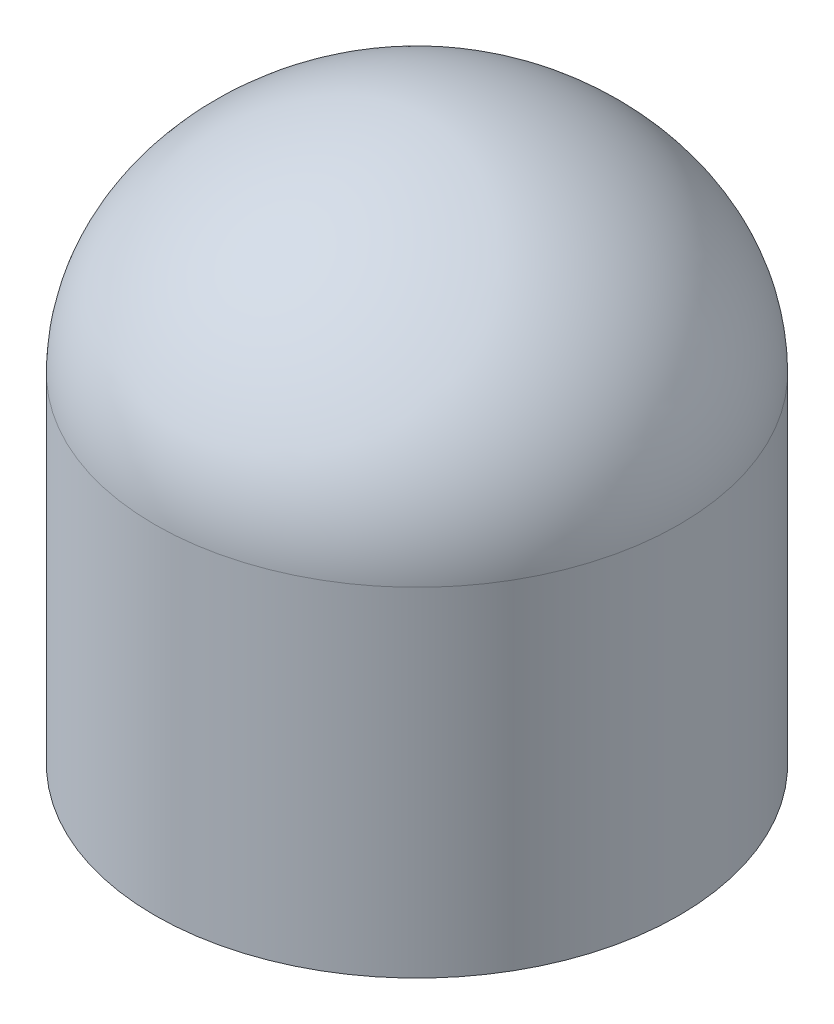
ISO-10303-21;
HEADER;
FILE_DESCRIPTION(('STEP AP214'),'2;1');
FILE_NAME('part.step','',(''),(''),'','','');
FILE_SCHEMA(('AUTOMOTIVE_DESIGN { 1 0 10303 214 1 1 1 1 }'));
ENDSEC;
DATA;
#1=APPLICATION_CONTEXT('core data for automotive mechanical design processes');
#2=APPLICATION_PROTOCOL_DEFINITION('international standard','automotive_design',2000,#1);
#3=PRODUCT_CONTEXT('',#1,'mechanical');
#4=PRODUCT('Part','Part','',(#3));
#5=PRODUCT_RELATED_PRODUCT_CATEGORY('part','',(#4));
#6=PRODUCT_DEFINITION_FORMATION('','',#4);
#7=PRODUCT_DEFINITION_CONTEXT('part definition',#1,'design');
#8=PRODUCT_DEFINITION('design','',#6,#7);
#9=PRODUCT_DEFINITION_SHAPE('','',#8);
#10=(LENGTH_UNIT() NAMED_UNIT(*) SI_UNIT(.MILLI.,.METRE.));
#11=(NAMED_UNIT(*) PLANE_ANGLE_UNIT() SI_UNIT($,.RADIAN.));
#12=(NAMED_UNIT(*) SI_UNIT($,.STERADIAN.) SOLID_ANGLE_UNIT());
#13=UNCERTAINTY_MEASURE_WITH_UNIT(LENGTH_MEASURE(1.E-05),#10,'distance_accuracy_value','');
#14=(GEOMETRIC_REPRESENTATION_CONTEXT(3) GLOBAL_UNCERTAINTY_ASSIGNED_CONTEXT((#13)) GLOBAL_UNIT_ASSIGNED_CONTEXT((#10,
#11,#12)) REPRESENTATION_CONTEXT('',''));
#15=CARTESIAN_POINT('',(0.,0.,0.));
#16=DIRECTION('',(0.,0.,1.));
#17=DIRECTION('',(1.,0.,0.));
#18=AXIS2_PLACEMENT_3D('',#15,#16,#17);
#19=CARTESIAN_POINT('',(7.62311967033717,83.6141321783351,334.5));
#20=DIRECTION('',(0.,-1.,0.));
#21=DIRECTION('',(0.,0.,-1.));
#22=AXIS2_PLACEMENT_3D('',#19,#20,#21);
#23=CYLINDRICAL_SURFACE('',#22,7.);
#24=CARTESIAN_POINT('',(7.62311967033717,80.1500305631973,334.5));
#25=DIRECTION('',(0.,-1.,0.));
#26=DIRECTION('',(0.,0.,-1.));
#27=AXIS2_PLACEMENT_3D('',#24,#25,#26);
#28=CIRCLE('',#27,7.);
#29=CARTESIAN_POINT('',(7.62311967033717,80.1500305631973,327.5));
#30=VERTEX_POINT('',#29);
#31=EDGE_CURVE('E13',#30,#30,#28,.T.);
#32=ORIENTED_EDGE('',*,*,#31,.F.);
#33=EDGE_LOOP('',(#32));
#34=FACE_BOUND('',#33,.T.);
#35=CARTESIAN_POINT('',(7.62311967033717,48.4500305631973,334.5));
#36=DIRECTION('',(0.,-1.,0.));
#37=DIRECTION('',(0.,0.,-1.));
#38=AXIS2_PLACEMENT_3D('',#35,#36,#37);
#39=CIRCLE('',#38,7.);
#40=CARTESIAN_POINT('',(7.62311967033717,48.4500305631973,327.5));
#41=VERTEX_POINT('',#40);
#42=EDGE_CURVE('E53',#41,#41,#39,.F.);
#43=ORIENTED_EDGE('',*,*,#42,.F.);
#44=EDGE_LOOP('',(#43));
#45=FACE_BOUND('',#44,.T.);
#46=ADVANCED_FACE('F49',(#34,#45),#23,.F.);
#47=CARTESIAN_POINT('',(0.623119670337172,80.1500305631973,334.5));
#48=DIRECTION('',(0.,1.,0.));
#49=DIRECTION('',(0.,0.,1.));
#50=AXIS2_PLACEMENT_3D('',#47,#48,#49);
#51=PLANE('',#50);
#52=CARTESIAN_POINT('',(7.62311967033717,80.1500305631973,334.5));
#53=DIRECTION('',(0.,-1.,0.));
#54=DIRECTION('',(0.,0.,-1.));
#55=AXIS2_PLACEMENT_3D('',#52,#53,#54);
#56=CIRCLE('',#55,6.);
#57=CARTESIAN_POINT('',(7.62311967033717,80.1500305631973,328.5));
#58=VERTEX_POINT('',#57);
#59=EDGE_CURVE('E58',#58,#58,#56,.T.);
#60=ORIENTED_EDGE('',*,*,#59,.F.);
#61=EDGE_LOOP('',(#60));
#62=FACE_BOUND('',#61,.T.);
#63=ORIENTED_EDGE('',*,*,#31,.T.);
#64=EDGE_LOOP('',(#63));
#65=FACE_BOUND('',#64,.T.);
#66=ADVANCED_FACE('F68',(#62,#65),#51,.F.);
#67=CARTESIAN_POINT('',(7.62311967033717,80.1500305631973,334.5));
#68=DIRECTION('',(0.,-1.,0.));
#69=DIRECTION('',(0.,0.,-1.));
#70=AXIS2_PLACEMENT_3D('',#67,#68,#69);
#71=CONICAL_SURFACE('',#70,6.,1.0471975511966);
#72=CARTESIAN_POINT('',(7.62311967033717,83.6141321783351,334.5));
#73=VERTEX_POINT('',#72);
#74=VERTEX_LOOP('',#73);
#75=FACE_BOUND('',#74,.T.);
#76=ORIENTED_EDGE('',*,*,#59,.T.);
#77=EDGE_LOOP('',(#76));
#78=FACE_BOUND('',#77,.T.);
#79=ADVANCED_FACE('F64',(#75,#78),#71,.F.);
#80=CARTESIAN_POINT('',(-29.9178623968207,48.4500305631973,315.));
#81=DIRECTION('',(0.,-1.,0.));
#82=DIRECTION('',(0.,0.,-1.));
#83=AXIS2_PLACEMENT_3D('',#80,#81,#82);
#84=PLANE('',#83);
#85=ORIENTED_EDGE('',*,*,#42,.T.);
#86=EDGE_LOOP('',(#85));
#87=FACE_BOUND('',#86,.T.);
#88=CARTESIAN_POINT('',(7.62311967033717,48.4500305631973,334.5));
#89=DIRECTION('',(0.,-1.,0.));
#90=DIRECTION('',(0.,0.,-1.));
#91=AXIS2_PLACEMENT_3D('',#88,#89,#90);
#92=CIRCLE('',#91,19.5);
#93=CARTESIAN_POINT('',(7.62311967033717,48.4500305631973,315.));
#94=VERTEX_POINT('',#93);
#95=EDGE_CURVE('E76',#94,#94,#92,.T.);
#96=ORIENTED_EDGE('',*,*,#95,.T.);
#97=EDGE_LOOP('',(#96));
#98=FACE_BOUND('',#97,.T.);
#99=ADVANCED_FACE('F67',(#87,#98),#84,.T.);
#100=CARTESIAN_POINT('',(7.62311967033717,90.1500305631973,334.5));
#101=CARTESIAN_POINT('',(-1.15578299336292,90.1500305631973,334.5));
#102=CARTESIAN_POINT('',(-11.8768803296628,83.2202883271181,334.5));
#103=CARTESIAN_POINT('',(-11.8768803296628,73.631742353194,334.5));
#104=B_SPLINE_CURVE_WITH_KNOTS('',3,(#100,#101,#102,#103),.UNSPECIFIED.,.F.,.F.,(4,4),(0.,1.),.UNSPECIFIED.);
#105=CARTESIAN_POINT('',(7.62311967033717,83.6141321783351,334.5));
#106=DIRECTION('',(0.,-1.,0.));
#107=AXIS1_PLACEMENT('',#105,#106);
#108=SURFACE_OF_REVOLUTION('',#104,#107);
#109=CARTESIAN_POINT('',(7.62311967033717,73.631742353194,334.5));
#110=DIRECTION('',(0.,-1.,0.));
#111=DIRECTION('',(0.,0.,-1.));
#112=AXIS2_PLACEMENT_3D('',#109,#110,#111);
#113=CIRCLE('',#112,19.5);
#114=CARTESIAN_POINT('',(7.62311967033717,73.631742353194,315.));
#115=VERTEX_POINT('',#114);
#116=EDGE_CURVE('E73',#115,#115,#113,.T.);
#117=ORIENTED_EDGE('',*,*,#116,.F.);
#118=EDGE_LOOP('',(#117));
#119=FACE_BOUND('',#118,.T.);
#120=CARTESIAN_POINT('',(7.62311967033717,90.1500305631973,334.5));
#121=VERTEX_POINT('',#120);
#122=VERTEX_LOOP('',#121);
#123=FACE_BOUND('',#122,.T.);
#124=ADVANCED_FACE('F87',(#119,#123),#108,.T.);
#125=CARTESIAN_POINT('',(7.62311967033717,83.6141321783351,334.5));
#126=DIRECTION('',(0.,-1.,0.));
#127=DIRECTION('',(0.,0.,-1.));
#128=AXIS2_PLACEMENT_3D('',#125,#126,#127);
#129=CYLINDRICAL_SURFACE('',#128,19.5);
#130=ORIENTED_EDGE('',*,*,#116,.T.);
#131=EDGE_LOOP('',(#130));
#132=FACE_BOUND('',#131,.T.);
#133=ORIENTED_EDGE('',*,*,#95,.F.);
#134=EDGE_LOOP('',(#133));
#135=FACE_BOUND('',#134,.T.);
#136=ADVANCED_FACE('F51',(#132,#135),#129,.T.);
#137=CLOSED_SHELL('',(#46,#66,#79,#99,#124,#136));
#138=MANIFOLD_SOLID_BREP('B2',#137);
#139=ADVANCED_BREP_SHAPE_REPRESENTATION('',(#18,#138),#14);
#140=SHAPE_DEFINITION_REPRESENTATION(#9,#139);
ENDSEC;
END-ISO-10303-21;
